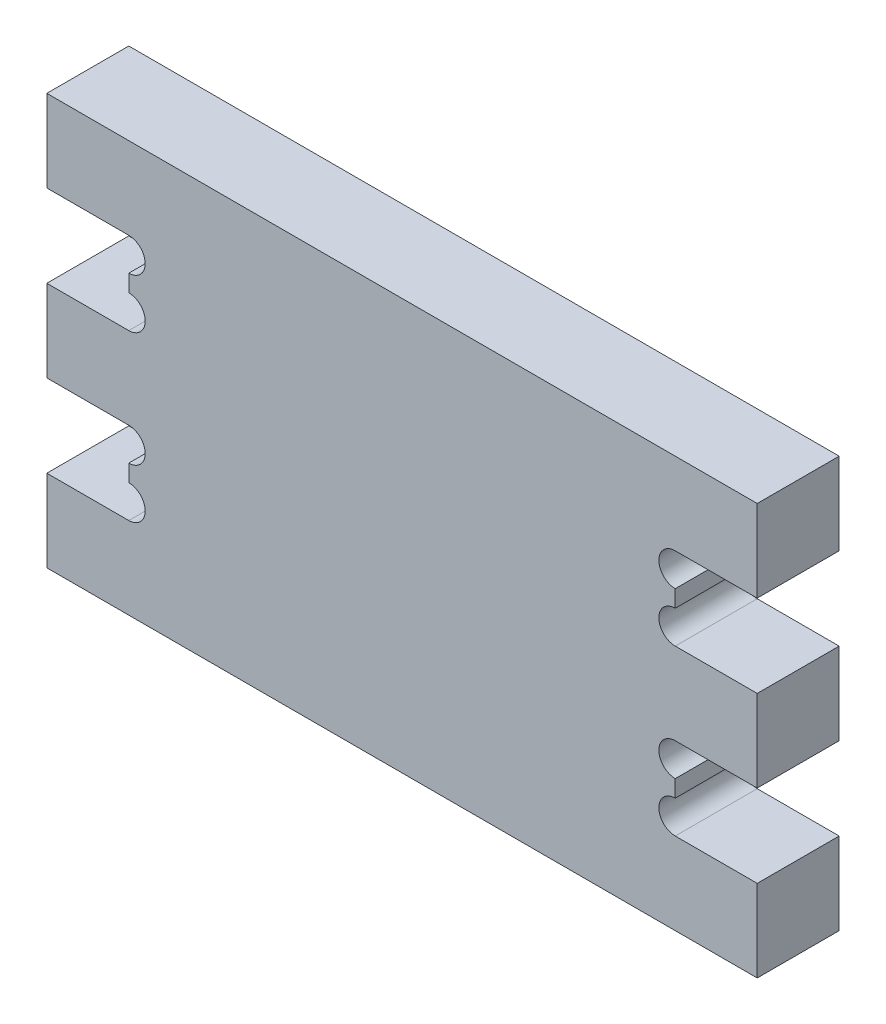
from build123d import *

# Parameters (mm, degrees)
OUTLINE_DEPTH = 15


with BuildPart() as part:
    # Skizze1 → outline (new body)
    with BuildSketch(Plane.XY):
        with BuildLine():
            Line((15, 82.6), (115, 82.6))
            Line((115, 82.6), (130, 82.6))
            Line((130, 82.6), (130, 67.6))
            Line((130, 67.6), (115, 67.6))
            ThreePointArc((115, 67.6), (112, 64.6), (115, 61.6))
            Line((115, 61.6), (115, 58.5))
            ThreePointArc((115, 58.5), (112, 55.5), (115, 52.5))
            Line((115, 52.5), (130, 52.5))
            Line((130, 52.5), (130, 37.5))
            Line((130, 37.5), (115, 37.5))
            ThreePointArc((115, 37.5), (112, 34.5), (115, 31.5))
            Line((115, 31.5), (115, 28.4))
            ThreePointArc((115, 28.4), (112, 25.4), (115, 22.4))
            Line((115, 22.4), (130, 22.4))
            Line((130, 22.4), (130, 7.4))
            Line((130, 7.4), (115, 7.4))
            Line((115, 7.4), (15, 7.4))
            Line((15, 7.4), (0, 7.4))
            Line((0, 7.4), (0, 22.4))
            Line((0, 22.4), (15, 22.4))
            ThreePointArc((15, 22.4), (18, 25.4), (15, 28.4))
            Line((15, 28.4), (15, 31.5))
            ThreePointArc((15, 31.5), (18, 34.5), (15, 37.5))
            Line((15, 37.5), (0, 37.5))
            Line((0, 37.5), (0, 52.5))
            Line((0, 52.5), (15, 52.5))
            ThreePointArc((15, 52.5), (18, 55.5), (15, 58.5))
            Line((15, 58.5), (15, 61.6))
            ThreePointArc((15, 61.6), (18, 64.6), (15, 67.6))
            Line((15, 67.6), (0, 67.6))
            Line((0, 67.6), (0, 82.6))
            Line((0, 82.6), (15, 82.6))
        make_face()
    extrude(amount=OUTLINE_DEPTH)


solid = part.part
